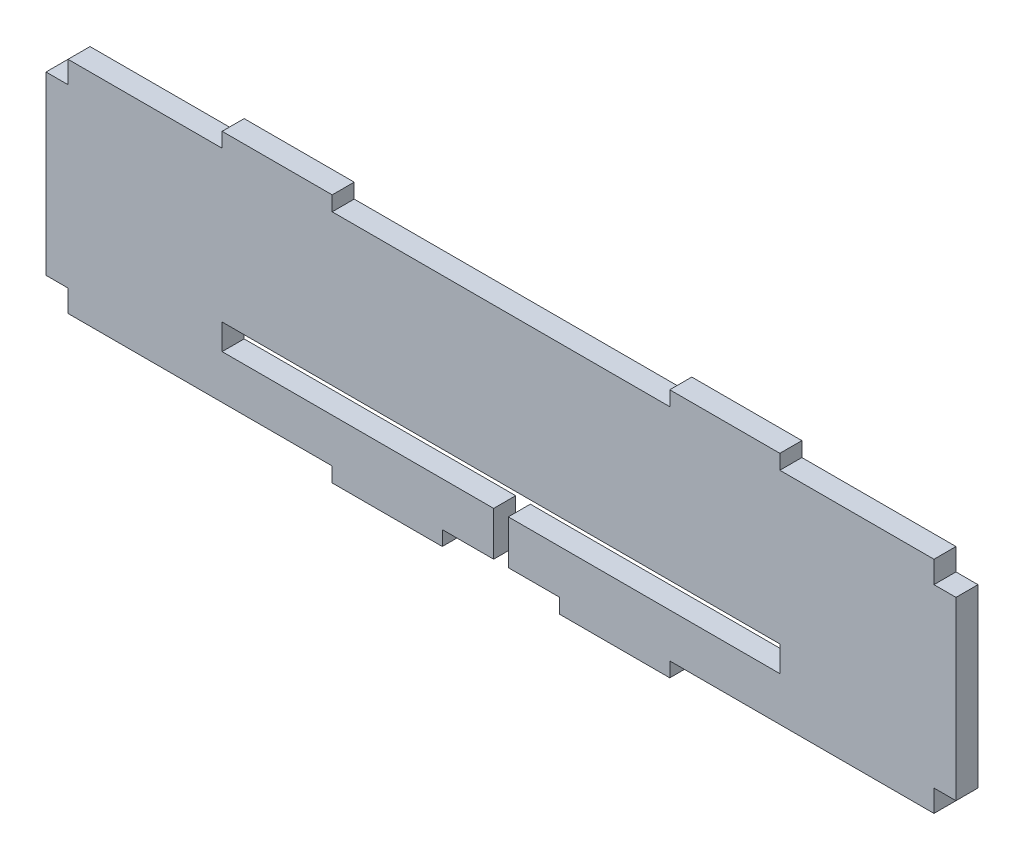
ISO-10303-21;
HEADER;
FILE_DESCRIPTION(('STEP AP214'),'2;1');
FILE_NAME('part.step','',(''),(''),'','','');
FILE_SCHEMA(('AUTOMOTIVE_DESIGN { 1 0 10303 214 1 1 1 1 }'));
ENDSEC;
DATA;
#1=APPLICATION_CONTEXT('core data for automotive mechanical design processes');
#2=APPLICATION_PROTOCOL_DEFINITION('international standard','automotive_design',2000,#1);
#3=PRODUCT_CONTEXT('',#1,'mechanical');
#4=PRODUCT('Part','Part','',(#3));
#5=PRODUCT_RELATED_PRODUCT_CATEGORY('part','',(#4));
#6=PRODUCT_DEFINITION_FORMATION('','',#4);
#7=PRODUCT_DEFINITION_CONTEXT('part definition',#1,'design');
#8=PRODUCT_DEFINITION('design','',#6,#7);
#9=PRODUCT_DEFINITION_SHAPE('','',#8);
#10=(LENGTH_UNIT() NAMED_UNIT(*) SI_UNIT(.MILLI.,.METRE.));
#11=(NAMED_UNIT(*) PLANE_ANGLE_UNIT() SI_UNIT($,.RADIAN.));
#12=(NAMED_UNIT(*) SI_UNIT($,.STERADIAN.) SOLID_ANGLE_UNIT());
#13=UNCERTAINTY_MEASURE_WITH_UNIT(LENGTH_MEASURE(1.E-05),#10,'distance_accuracy_value','');
#14=(GEOMETRIC_REPRESENTATION_CONTEXT(3) GLOBAL_UNCERTAINTY_ASSIGNED_CONTEXT((#13)) GLOBAL_UNIT_ASSIGNED_CONTEXT((#10,
#11,#12)) REPRESENTATION_CONTEXT('',''));
#15=CARTESIAN_POINT('',(0.,0.,0.));
#16=DIRECTION('',(0.,0.,1.));
#17=DIRECTION('',(1.,0.,0.));
#18=AXIS2_PLACEMENT_3D('',#15,#16,#17);
#19=CARTESIAN_POINT('',(0.,30.,3.));
#20=DIRECTION('',(0.,1.,0.));
#21=DIRECTION('',(0.,0.,1.));
#22=AXIS2_PLACEMENT_3D('',#19,#20,#21);
#23=PLANE('',#22);
#24=DIRECTION('',(1.,0.,0.));
#25=VECTOR('',#24,1.);
#26=CARTESIAN_POINT('',(0.,30.,0.));
#27=LINE('',#26,#25);
#28=CARTESIAN_POINT('',(6.00000000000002,30.,0.));
#29=VERTEX_POINT('',#28);
#30=CARTESIAN_POINT('',(27.,30.,0.));
#31=VERTEX_POINT('',#30);
#32=EDGE_CURVE('E299',#29,#31,#27,.T.);
#33=ORIENTED_EDGE('',*,*,#32,.F.);
#34=DIRECTION('',(0.,0.,-1.));
#35=VECTOR('',#34,1.);
#36=CARTESIAN_POINT('',(6.00000000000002,30.,3.));
#37=LINE('',#36,#35);
#38=CARTESIAN_POINT('',(6.00000000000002,30.,3.));
#39=VERTEX_POINT('',#38);
#40=EDGE_CURVE('E11',#39,#29,#37,.T.);
#41=ORIENTED_EDGE('',*,*,#40,.F.);
#42=DIRECTION('',(1.,0.,0.));
#43=VECTOR('',#42,1.);
#44=CARTESIAN_POINT('',(0.,30.,3.));
#45=LINE('',#44,#43);
#46=CARTESIAN_POINT('',(27.,30.,3.));
#47=VERTEX_POINT('',#46);
#48=EDGE_CURVE('E389',#39,#47,#45,.T.);
#49=ORIENTED_EDGE('',*,*,#48,.T.);
#50=DIRECTION('',(0.,0.,-1.));
#51=VECTOR('',#50,1.);
#52=CARTESIAN_POINT('',(27.,30.,3.));
#53=LINE('',#52,#51);
#54=EDGE_CURVE('E53',#47,#31,#53,.T.);
#55=ORIENTED_EDGE('',*,*,#54,.T.);
#56=EDGE_LOOP('',(#33,#41,#49,#55));
#57=FACE_BOUND('',#56,.T.);
#58=ADVANCED_FACE('F37',(#57),#23,.T.);
#59=CARTESIAN_POINT('',(6.00000000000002,0.,3.));
#60=DIRECTION('',(1.,0.,0.));
#61=DIRECTION('',(0.,0.,-1.));
#62=AXIS2_PLACEMENT_3D('',#59,#60,#61);
#63=PLANE('',#62);
#64=DIRECTION('',(0.,-1.,0.));
#65=VECTOR('',#64,1.);
#66=CARTESIAN_POINT('',(6.00000000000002,0.,0.));
#67=LINE('',#66,#65);
#68=CARTESIAN_POINT('',(6.00000000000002,27.,0.));
#69=VERTEX_POINT('',#68);
#70=EDGE_CURVE('E301',#29,#69,#67,.T.);
#71=ORIENTED_EDGE('',*,*,#70,.T.);
#72=DIRECTION('',(0.,0.,-1.));
#73=VECTOR('',#72,1.);
#74=CARTESIAN_POINT('',(6.00000000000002,27.,3.));
#75=LINE('',#74,#73);
#76=CARTESIAN_POINT('',(6.00000000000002,27.,3.));
#77=VERTEX_POINT('',#76);
#78=EDGE_CURVE('E45',#77,#69,#75,.T.);
#79=ORIENTED_EDGE('',*,*,#78,.F.);
#80=DIRECTION('',(0.,-1.,0.));
#81=VECTOR('',#80,1.);
#82=CARTESIAN_POINT('',(6.00000000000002,0.,3.));
#83=LINE('',#82,#81);
#84=EDGE_CURVE('E485',#39,#77,#83,.T.);
#85=ORIENTED_EDGE('',*,*,#84,.F.);
#86=ORIENTED_EDGE('',*,*,#40,.T.);
#87=EDGE_LOOP('',(#71,#79,#85,#86));
#88=FACE_BOUND('',#87,.T.);
#89=ADVANCED_FACE('F474',(#88),#63,.F.);
#90=CARTESIAN_POINT('',(0.,27.,3.));
#91=DIRECTION('',(0.,1.,0.));
#92=DIRECTION('',(0.,0.,1.));
#93=AXIS2_PLACEMENT_3D('',#90,#91,#92);
#94=PLANE('',#93);
#95=DIRECTION('',(1.,0.,0.));
#96=VECTOR('',#95,1.);
#97=CARTESIAN_POINT('',(0.,27.,0.));
#98=LINE('',#97,#96);
#99=CARTESIAN_POINT('',(3.00000000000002,27.,0.));
#100=VERTEX_POINT('',#99);
#101=EDGE_CURVE('E304',#100,#69,#98,.T.);
#102=ORIENTED_EDGE('',*,*,#101,.F.);
#103=DIRECTION('',(0.,0.,-1.));
#104=VECTOR('',#103,1.);
#105=CARTESIAN_POINT('',(3.00000000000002,27.,3.));
#106=LINE('',#105,#104);
#107=CARTESIAN_POINT('',(3.00000000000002,27.,3.));
#108=VERTEX_POINT('',#107);
#109=EDGE_CURVE('E464',#108,#100,#106,.T.);
#110=ORIENTED_EDGE('',*,*,#109,.F.);
#111=DIRECTION('',(1.,0.,0.));
#112=VECTOR('',#111,1.);
#113=CARTESIAN_POINT('',(0.,27.,3.));
#114=LINE('',#113,#112);
#115=EDGE_CURVE('E471',#108,#77,#114,.T.);
#116=ORIENTED_EDGE('',*,*,#115,.T.);
#117=ORIENTED_EDGE('',*,*,#78,.T.);
#118=EDGE_LOOP('',(#102,#110,#116,#117));
#119=FACE_BOUND('',#118,.T.);
#120=ADVANCED_FACE('F469',(#119),#94,.T.);
#121=CARTESIAN_POINT('',(3.00000000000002,0.,3.));
#122=DIRECTION('',(-1.,0.,0.));
#123=DIRECTION('',(0.,0.,1.));
#124=AXIS2_PLACEMENT_3D('',#121,#122,#123);
#125=PLANE('',#124);
#126=DIRECTION('',(0.,1.,0.));
#127=VECTOR('',#126,1.);
#128=CARTESIAN_POINT('',(3.00000000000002,0.,0.));
#129=LINE('',#128,#127);
#130=CARTESIAN_POINT('',(3.00000000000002,3.,0.));
#131=VERTEX_POINT('',#130);
#132=EDGE_CURVE('E307',#131,#100,#129,.T.);
#133=ORIENTED_EDGE('',*,*,#132,.F.);
#134=DIRECTION('',(0.,0.,-1.));
#135=VECTOR('',#134,1.);
#136=CARTESIAN_POINT('',(3.00000000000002,3.,3.));
#137=LINE('',#136,#135);
#138=CARTESIAN_POINT('',(3.00000000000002,3.,3.));
#139=VERTEX_POINT('',#138);
#140=EDGE_CURVE('E462',#139,#131,#137,.T.);
#141=ORIENTED_EDGE('',*,*,#140,.F.);
#142=DIRECTION('',(0.,1.,0.));
#143=VECTOR('',#142,1.);
#144=CARTESIAN_POINT('',(3.00000000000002,0.,3.));
#145=LINE('',#144,#143);
#146=EDGE_CURVE('E484',#139,#108,#145,.T.);
#147=ORIENTED_EDGE('',*,*,#146,.T.);
#148=ORIENTED_EDGE('',*,*,#109,.T.);
#149=EDGE_LOOP('',(#133,#141,#147,#148));
#150=FACE_BOUND('',#149,.T.);
#151=ADVANCED_FACE('F480',(#150),#125,.T.);
#152=CARTESIAN_POINT('',(0.,3.,3.));
#153=DIRECTION('',(0.,1.,0.));
#154=DIRECTION('',(0.,0.,1.));
#155=AXIS2_PLACEMENT_3D('',#152,#153,#154);
#156=PLANE('',#155);
#157=DIRECTION('',(1.,0.,0.));
#158=VECTOR('',#157,1.);
#159=CARTESIAN_POINT('',(0.,3.,0.));
#160=LINE('',#159,#158);
#161=CARTESIAN_POINT('',(6.00000000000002,3.,0.));
#162=VERTEX_POINT('',#161);
#163=EDGE_CURVE('E310',#131,#162,#160,.T.);
#164=ORIENTED_EDGE('',*,*,#163,.T.);
#165=DIRECTION('',(0.,0.,-1.));
#166=VECTOR('',#165,1.);
#167=CARTESIAN_POINT('',(6.00000000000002,3.,3.));
#168=LINE('',#167,#166);
#169=CARTESIAN_POINT('',(6.00000000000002,3.,3.));
#170=VERTEX_POINT('',#169);
#171=EDGE_CURVE('E460',#170,#162,#168,.T.);
#172=ORIENTED_EDGE('',*,*,#171,.F.);
#173=DIRECTION('',(1.,0.,0.));
#174=VECTOR('',#173,1.);
#175=CARTESIAN_POINT('',(0.,3.,3.));
#176=LINE('',#175,#174);
#177=EDGE_CURVE('E487',#139,#170,#176,.T.);
#178=ORIENTED_EDGE('',*,*,#177,.F.);
#179=ORIENTED_EDGE('',*,*,#140,.T.);
#180=EDGE_LOOP('',(#164,#172,#178,#179));
#181=FACE_BOUND('',#180,.T.);
#182=ADVANCED_FACE('F579',(#181),#156,.F.);
#183=CARTESIAN_POINT('',(6.00000000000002,0.,3.));
#184=DIRECTION('',(-1.,0.,0.));
#185=DIRECTION('',(0.,0.,1.));
#186=AXIS2_PLACEMENT_3D('',#183,#184,#185);
#187=PLANE('',#186);
#188=DIRECTION('',(0.,1.,0.));
#189=VECTOR('',#188,1.);
#190=CARTESIAN_POINT('',(6.00000000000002,0.,0.));
#191=LINE('',#190,#189);
#192=CARTESIAN_POINT('',(6.00000000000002,0.,0.));
#193=VERTEX_POINT('',#192);
#194=EDGE_CURVE('E313',#193,#162,#191,.T.);
#195=ORIENTED_EDGE('',*,*,#194,.F.);
#196=DIRECTION('',(0.,0.,-1.));
#197=VECTOR('',#196,1.);
#198=CARTESIAN_POINT('',(6.00000000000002,0.,3.));
#199=LINE('',#198,#197);
#200=CARTESIAN_POINT('',(6.00000000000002,0.,3.));
#201=VERTEX_POINT('',#200);
#202=EDGE_CURVE('E458',#201,#193,#199,.T.);
#203=ORIENTED_EDGE('',*,*,#202,.F.);
#204=DIRECTION('',(0.,1.,0.));
#205=VECTOR('',#204,1.);
#206=CARTESIAN_POINT('',(6.00000000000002,0.,3.));
#207=LINE('',#206,#205);
#208=EDGE_CURVE('E493',#201,#170,#207,.T.);
#209=ORIENTED_EDGE('',*,*,#208,.T.);
#210=ORIENTED_EDGE('',*,*,#171,.T.);
#211=EDGE_LOOP('',(#195,#203,#209,#210));
#212=FACE_BOUND('',#211,.T.);
#213=ADVANCED_FACE('F582',(#212),#187,.T.);
#214=CARTESIAN_POINT('',(0.,0.,3.));
#215=DIRECTION('',(0.,1.,0.));
#216=DIRECTION('',(0.,0.,1.));
#217=AXIS2_PLACEMENT_3D('',#214,#215,#216);
#218=PLANE('',#217);
#219=DIRECTION('',(1.,0.,0.));
#220=VECTOR('',#219,1.);
#221=CARTESIAN_POINT('',(0.,0.,0.));
#222=LINE('',#221,#220);
#223=CARTESIAN_POINT('',(42.,0.,0.));
#224=VERTEX_POINT('',#223);
#225=EDGE_CURVE('E316',#193,#224,#222,.T.);
#226=ORIENTED_EDGE('',*,*,#225,.T.);
#227=DIRECTION('',(0.,0.,-1.));
#228=VECTOR('',#227,1.);
#229=CARTESIAN_POINT('',(42.,0.,3.));
#230=LINE('',#229,#228);
#231=CARTESIAN_POINT('',(42.,0.,3.));
#232=VERTEX_POINT('',#231);
#233=EDGE_CURVE('E455',#232,#224,#230,.T.);
#234=ORIENTED_EDGE('',*,*,#233,.F.);
#235=DIRECTION('',(1.,0.,0.));
#236=VECTOR('',#235,1.);
#237=CARTESIAN_POINT('',(0.,0.,3.));
#238=LINE('',#237,#236);
#239=EDGE_CURVE('E496',#201,#232,#238,.T.);
#240=ORIENTED_EDGE('',*,*,#239,.F.);
#241=ORIENTED_EDGE('',*,*,#202,.T.);
#242=EDGE_LOOP('',(#226,#234,#240,#241));
#243=FACE_BOUND('',#242,.T.);
#244=ADVANCED_FACE('F586',(#243),#218,.F.);
#245=CARTESIAN_POINT('',(42.,2.91433543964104E-13,3.));
#246=DIRECTION('',(1.,0.,0.));
#247=DIRECTION('',(0.,1.,0.));
#248=AXIS2_PLACEMENT_3D('',#245,#246,#247);
#249=PLANE('',#248);
#250=DIRECTION('',(0.,-1.,0.));
#251=VECTOR('',#250,1.);
#252=CARTESIAN_POINT('',(42.,2.91433543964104E-13,0.));
#253=LINE('',#252,#251);
#254=CARTESIAN_POINT('',(42.,-2.,0.));
#255=VERTEX_POINT('',#254);
#256=EDGE_CURVE('E318',#224,#255,#253,.T.);
#257=ORIENTED_EDGE('',*,*,#256,.T.);
#258=DIRECTION('',(0.,0.,-1.));
#259=VECTOR('',#258,1.);
#260=CARTESIAN_POINT('',(42.,-2.,3.));
#261=LINE('',#260,#259);
#262=CARTESIAN_POINT('',(42.,-2.,3.));
#263=VERTEX_POINT('',#262);
#264=EDGE_CURVE('E452',#263,#255,#261,.T.);
#265=ORIENTED_EDGE('',*,*,#264,.F.);
#266=DIRECTION('',(0.,-1.,0.));
#267=VECTOR('',#266,1.);
#268=CARTESIAN_POINT('',(42.,2.91433543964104E-13,3.));
#269=LINE('',#268,#267);
#270=EDGE_CURVE('E498',#232,#263,#269,.T.);
#271=ORIENTED_EDGE('',*,*,#270,.F.);
#272=ORIENTED_EDGE('',*,*,#233,.T.);
#273=EDGE_LOOP('',(#257,#265,#271,#272));
#274=FACE_BOUND('',#273,.T.);
#275=ADVANCED_FACE('F590',(#274),#249,.F.);
#276=CARTESIAN_POINT('',(0.,-2.,3.));
#277=DIRECTION('',(0.,1.,0.));
#278=DIRECTION('',(-1.,0.,0.));
#279=AXIS2_PLACEMENT_3D('',#276,#277,#278);
#280=PLANE('',#279);
#281=DIRECTION('',(1.,0.,0.));
#282=VECTOR('',#281,1.);
#283=CARTESIAN_POINT('',(0.,-2.,0.));
#284=LINE('',#283,#282);
#285=CARTESIAN_POINT('',(57.,-2.,0.));
#286=VERTEX_POINT('',#285);
#287=EDGE_CURVE('E320',#255,#286,#284,.T.);
#288=ORIENTED_EDGE('',*,*,#287,.T.);
#289=DIRECTION('',(0.,0.,-1.));
#290=VECTOR('',#289,1.);
#291=CARTESIAN_POINT('',(57.,-2.,3.));
#292=LINE('',#291,#290);
#293=CARTESIAN_POINT('',(57.,-2.,3.));
#294=VERTEX_POINT('',#293);
#295=EDGE_CURVE('E449',#294,#286,#292,.T.);
#296=ORIENTED_EDGE('',*,*,#295,.F.);
#297=DIRECTION('',(1.,0.,0.));
#298=VECTOR('',#297,1.);
#299=CARTESIAN_POINT('',(0.,-2.,3.));
#300=LINE('',#299,#298);
#301=EDGE_CURVE('E500',#263,#294,#300,.T.);
#302=ORIENTED_EDGE('',*,*,#301,.F.);
#303=ORIENTED_EDGE('',*,*,#264,.T.);
#304=EDGE_LOOP('',(#288,#296,#302,#303));
#305=FACE_BOUND('',#304,.T.);
#306=ADVANCED_FACE('F594',(#305),#280,.F.);
#307=CARTESIAN_POINT('',(57.,0.,3.));
#308=DIRECTION('',(-1.,0.,0.));
#309=DIRECTION('',(0.,0.,1.));
#310=AXIS2_PLACEMENT_3D('',#307,#308,#309);
#311=PLANE('',#310);
#312=DIRECTION('',(0.,1.,0.));
#313=VECTOR('',#312,1.);
#314=CARTESIAN_POINT('',(57.,0.,0.));
#315=LINE('',#314,#313);
#316=CARTESIAN_POINT('',(57.,0.,0.));
#317=VERTEX_POINT('',#316);
#318=EDGE_CURVE('E322',#286,#317,#315,.T.);
#319=ORIENTED_EDGE('',*,*,#318,.T.);
#320=DIRECTION('',(0.,0.,-1.));
#321=VECTOR('',#320,1.);
#322=CARTESIAN_POINT('',(57.,0.,3.));
#323=LINE('',#322,#321);
#324=CARTESIAN_POINT('',(57.,0.,3.));
#325=VERTEX_POINT('',#324);
#326=EDGE_CURVE('E446',#325,#317,#323,.T.);
#327=ORIENTED_EDGE('',*,*,#326,.F.);
#328=DIRECTION('',(0.,1.,0.));
#329=VECTOR('',#328,1.);
#330=CARTESIAN_POINT('',(57.,0.,3.));
#331=LINE('',#330,#329);
#332=EDGE_CURVE('E502',#294,#325,#331,.T.);
#333=ORIENTED_EDGE('',*,*,#332,.F.);
#334=ORIENTED_EDGE('',*,*,#295,.T.);
#335=EDGE_LOOP('',(#319,#327,#333,#334));
#336=FACE_BOUND('',#335,.T.);
#337=ADVANCED_FACE('F598',(#336),#311,.F.);
#338=CARTESIAN_POINT('',(0.,0.,3.));
#339=DIRECTION('',(0.,1.,0.));
#340=DIRECTION('',(-1.,0.,0.));
#341=AXIS2_PLACEMENT_3D('',#338,#339,#340);
#342=PLANE('',#341);
#343=DIRECTION('',(1.,0.,0.));
#344=VECTOR('',#343,1.);
#345=CARTESIAN_POINT('',(0.,0.,0.));
#346=LINE('',#345,#344);
#347=CARTESIAN_POINT('',(64.,0.,0.));
#348=VERTEX_POINT('',#347);
#349=EDGE_CURVE('E324',#317,#348,#346,.T.);
#350=ORIENTED_EDGE('',*,*,#349,.T.);
#351=DIRECTION('',(0.,0.,-1.));
#352=VECTOR('',#351,1.);
#353=CARTESIAN_POINT('',(64.,0.,3.));
#354=LINE('',#353,#352);
#355=CARTESIAN_POINT('',(64.,0.,3.));
#356=VERTEX_POINT('',#355);
#357=EDGE_CURVE('E443',#356,#348,#354,.T.);
#358=ORIENTED_EDGE('',*,*,#357,.F.);
#359=DIRECTION('',(1.,0.,0.));
#360=VECTOR('',#359,1.);
#361=CARTESIAN_POINT('',(0.,0.,3.));
#362=LINE('',#361,#360);
#363=EDGE_CURVE('E504',#325,#356,#362,.T.);
#364=ORIENTED_EDGE('',*,*,#363,.F.);
#365=ORIENTED_EDGE('',*,*,#326,.T.);
#366=EDGE_LOOP('',(#350,#358,#364,#365));
#367=FACE_BOUND('',#366,.T.);
#368=ADVANCED_FACE('F602',(#367),#342,.F.);
#369=CARTESIAN_POINT('',(64.,0.,3.));
#370=DIRECTION('',(-1.,0.,0.));
#371=DIRECTION('',(0.,0.,1.));
#372=AXIS2_PLACEMENT_3D('',#369,#370,#371);
#373=PLANE('',#372);
#374=DIRECTION('',(0.,1.,0.));
#375=VECTOR('',#374,1.);
#376=CARTESIAN_POINT('',(64.,0.,0.));
#377=LINE('',#376,#375);
#378=CARTESIAN_POINT('',(64.,6.,0.));
#379=VERTEX_POINT('',#378);
#380=EDGE_CURVE('E326',#348,#379,#377,.T.);
#381=ORIENTED_EDGE('',*,*,#380,.T.);
#382=DIRECTION('',(0.,0.,-1.));
#383=VECTOR('',#382,1.);
#384=CARTESIAN_POINT('',(64.,6.,3.));
#385=LINE('',#384,#383);
#386=CARTESIAN_POINT('',(64.,6.,3.));
#387=VERTEX_POINT('',#386);
#388=EDGE_CURVE('E441',#387,#379,#385,.T.);
#389=ORIENTED_EDGE('',*,*,#388,.F.);
#390=DIRECTION('',(0.,1.,0.));
#391=VECTOR('',#390,1.);
#392=CARTESIAN_POINT('',(64.,0.,3.));
#393=LINE('',#392,#391);
#394=EDGE_CURVE('E506',#356,#387,#393,.T.);
#395=ORIENTED_EDGE('',*,*,#394,.F.);
#396=ORIENTED_EDGE('',*,*,#357,.T.);
#397=EDGE_LOOP('',(#381,#389,#395,#396));
#398=FACE_BOUND('',#397,.T.);
#399=ADVANCED_FACE('F604',(#398),#373,.F.);
#400=CARTESIAN_POINT('',(0.,6.,3.));
#401=DIRECTION('',(0.,1.,0.));
#402=DIRECTION('',(0.,0.,1.));
#403=AXIS2_PLACEMENT_3D('',#400,#401,#402);
#404=PLANE('',#403);
#405=DIRECTION('',(1.,0.,0.));
#406=VECTOR('',#405,1.);
#407=CARTESIAN_POINT('',(0.,6.,0.));
#408=LINE('',#407,#406);
#409=CARTESIAN_POINT('',(27.,6.,0.));
#410=VERTEX_POINT('',#409);
#411=EDGE_CURVE('E330',#410,#379,#408,.T.);
#412=ORIENTED_EDGE('',*,*,#411,.F.);
#413=DIRECTION('',(0.,0.,-1.));
#414=VECTOR('',#413,1.);
#415=CARTESIAN_POINT('',(27.,6.,3.));
#416=LINE('',#415,#414);
#417=CARTESIAN_POINT('',(27.,6.,3.));
#418=VERTEX_POINT('',#417);
#419=EDGE_CURVE('E439',#418,#410,#416,.T.);
#420=ORIENTED_EDGE('',*,*,#419,.F.);
#421=DIRECTION('',(1.,0.,0.));
#422=VECTOR('',#421,1.);
#423=CARTESIAN_POINT('',(0.,6.,3.));
#424=LINE('',#423,#422);
#425=EDGE_CURVE('E509',#418,#387,#424,.T.);
#426=ORIENTED_EDGE('',*,*,#425,.T.);
#427=ORIENTED_EDGE('',*,*,#388,.T.);
#428=EDGE_LOOP('',(#412,#420,#426,#427));
#429=FACE_BOUND('',#428,.T.);
#430=ADVANCED_FACE('F607',(#429),#404,.T.);
#431=CARTESIAN_POINT('',(27.,0.,3.));
#432=DIRECTION('',(1.,0.,0.));
#433=DIRECTION('',(0.,0.,-1.));
#434=AXIS2_PLACEMENT_3D('',#431,#432,#433);
#435=PLANE('',#434);
#436=DIRECTION('',(0.,-1.,0.));
#437=VECTOR('',#436,1.);
#438=CARTESIAN_POINT('',(27.,0.,0.));
#439=LINE('',#438,#437);
#440=CARTESIAN_POINT('',(27.,9.5,0.));
#441=VERTEX_POINT('',#440);
#442=EDGE_CURVE('E333',#441,#410,#439,.T.);
#443=ORIENTED_EDGE('',*,*,#442,.F.);
#444=DIRECTION('',(0.,0.,-1.));
#445=VECTOR('',#444,1.);
#446=CARTESIAN_POINT('',(27.,9.5,3.));
#447=LINE('',#446,#445);
#448=CARTESIAN_POINT('',(27.,9.5,3.));
#449=VERTEX_POINT('',#448);
#450=EDGE_CURVE('E437',#449,#441,#447,.T.);
#451=ORIENTED_EDGE('',*,*,#450,.F.);
#452=DIRECTION('',(0.,-1.,0.));
#453=VECTOR('',#452,1.);
#454=CARTESIAN_POINT('',(27.,0.,3.));
#455=LINE('',#454,#453);
#456=EDGE_CURVE('E512',#449,#418,#455,.T.);
#457=ORIENTED_EDGE('',*,*,#456,.T.);
#458=ORIENTED_EDGE('',*,*,#419,.T.);
#459=EDGE_LOOP('',(#443,#451,#457,#458));
#460=FACE_BOUND('',#459,.T.);
#461=ADVANCED_FACE('F611',(#460),#435,.T.);
#462=CARTESIAN_POINT('',(0.,9.5,3.));
#463=DIRECTION('',(0.,1.,0.));
#464=DIRECTION('',(0.,0.,1.));
#465=AXIS2_PLACEMENT_3D('',#462,#463,#464);
#466=PLANE('',#465);
#467=DIRECTION('',(1.,0.,0.));
#468=VECTOR('',#467,1.);
#469=CARTESIAN_POINT('',(0.,9.5,0.));
#470=LINE('',#469,#468);
#471=CARTESIAN_POINT('',(103.,9.5,0.));
#472=VERTEX_POINT('',#471);
#473=EDGE_CURVE('E336',#441,#472,#470,.T.);
#474=ORIENTED_EDGE('',*,*,#473,.T.);
#475=DIRECTION('',(0.,0.,-1.));
#476=VECTOR('',#475,1.);
#477=CARTESIAN_POINT('',(103.,9.5,3.));
#478=LINE('',#477,#476);
#479=CARTESIAN_POINT('',(103.,9.5,3.));
#480=VERTEX_POINT('',#479);
#481=EDGE_CURVE('E434',#480,#472,#478,.T.);
#482=ORIENTED_EDGE('',*,*,#481,.F.);
#483=DIRECTION('',(1.,0.,0.));
#484=VECTOR('',#483,1.);
#485=CARTESIAN_POINT('',(0.,9.5,3.));
#486=LINE('',#485,#484);
#487=EDGE_CURVE('E515',#449,#480,#486,.T.);
#488=ORIENTED_EDGE('',*,*,#487,.F.);
#489=ORIENTED_EDGE('',*,*,#450,.T.);
#490=EDGE_LOOP('',(#474,#482,#488,#489));
#491=FACE_BOUND('',#490,.T.);
#492=ADVANCED_FACE('F615',(#491),#466,.F.);
#493=CARTESIAN_POINT('',(103.,0.,3.));
#494=DIRECTION('',(1.,0.,0.));
#495=DIRECTION('',(0.,0.,-1.));
#496=AXIS2_PLACEMENT_3D('',#493,#494,#495);
#497=PLANE('',#496);
#498=DIRECTION('',(0.,-1.,0.));
#499=VECTOR('',#498,1.);
#500=CARTESIAN_POINT('',(103.,0.,0.));
#501=LINE('',#500,#499);
#502=CARTESIAN_POINT('',(103.,6.,0.));
#503=VERTEX_POINT('',#502);
#504=EDGE_CURVE('E338',#472,#503,#501,.T.);
#505=ORIENTED_EDGE('',*,*,#504,.T.);
#506=DIRECTION('',(0.,0.,-1.));
#507=VECTOR('',#506,1.);
#508=CARTESIAN_POINT('',(103.,6.,3.));
#509=LINE('',#508,#507);
#510=CARTESIAN_POINT('',(103.,6.,3.));
#511=VERTEX_POINT('',#510);
#512=EDGE_CURVE('E432',#511,#503,#509,.T.);
#513=ORIENTED_EDGE('',*,*,#512,.F.);
#514=DIRECTION('',(0.,-1.,0.));
#515=VECTOR('',#514,1.);
#516=CARTESIAN_POINT('',(103.,0.,3.));
#517=LINE('',#516,#515);
#518=EDGE_CURVE('E517',#480,#511,#517,.T.);
#519=ORIENTED_EDGE('',*,*,#518,.F.);
#520=ORIENTED_EDGE('',*,*,#481,.T.);
#521=EDGE_LOOP('',(#505,#513,#519,#520));
#522=FACE_BOUND('',#521,.T.);
#523=ADVANCED_FACE('F619',(#522),#497,.F.);
#524=CARTESIAN_POINT('',(0.,6.,3.));
#525=DIRECTION('',(0.,1.,0.));
#526=DIRECTION('',(0.,0.,1.));
#527=AXIS2_PLACEMENT_3D('',#524,#525,#526);
#528=PLANE('',#527);
#529=DIRECTION('',(1.,0.,0.));
#530=VECTOR('',#529,1.);
#531=CARTESIAN_POINT('',(0.,6.,0.));
#532=LINE('',#531,#530);
#533=CARTESIAN_POINT('',(66.,6.,0.));
#534=VERTEX_POINT('',#533);
#535=EDGE_CURVE('E341',#534,#503,#532,.T.);
#536=ORIENTED_EDGE('',*,*,#535,.F.);
#537=DIRECTION('',(0.,0.,-1.));
#538=VECTOR('',#537,1.);
#539=CARTESIAN_POINT('',(66.,6.,3.));
#540=LINE('',#539,#538);
#541=CARTESIAN_POINT('',(66.,6.,3.));
#542=VERTEX_POINT('',#541);
#543=EDGE_CURVE('E430',#542,#534,#540,.T.);
#544=ORIENTED_EDGE('',*,*,#543,.F.);
#545=DIRECTION('',(1.,0.,0.));
#546=VECTOR('',#545,1.);
#547=CARTESIAN_POINT('',(0.,6.,3.));
#548=LINE('',#547,#546);
#549=EDGE_CURVE('E519',#542,#511,#548,.T.);
#550=ORIENTED_EDGE('',*,*,#549,.T.);
#551=ORIENTED_EDGE('',*,*,#512,.T.);
#552=EDGE_LOOP('',(#536,#544,#550,#551));
#553=FACE_BOUND('',#552,.T.);
#554=ADVANCED_FACE('F623',(#553),#528,.T.);
#555=CARTESIAN_POINT('',(66.,0.,3.));
#556=DIRECTION('',(-1.,0.,0.));
#557=DIRECTION('',(0.,0.,1.));
#558=AXIS2_PLACEMENT_3D('',#555,#556,#557);
#559=PLANE('',#558);
#560=DIRECTION('',(0.,1.,0.));
#561=VECTOR('',#560,1.);
#562=CARTESIAN_POINT('',(66.,0.,0.));
#563=LINE('',#562,#561);
#564=CARTESIAN_POINT('',(66.,0.,0.));
#565=VERTEX_POINT('',#564);
#566=EDGE_CURVE('E344',#565,#534,#563,.T.);
#567=ORIENTED_EDGE('',*,*,#566,.F.);
#568=DIRECTION('',(0.,0.,-1.));
#569=VECTOR('',#568,1.);
#570=CARTESIAN_POINT('',(66.,0.,3.));
#571=LINE('',#570,#569);
#572=CARTESIAN_POINT('',(66.,0.,3.));
#573=VERTEX_POINT('',#572);
#574=EDGE_CURVE('E428',#573,#565,#571,.T.);
#575=ORIENTED_EDGE('',*,*,#574,.F.);
#576=DIRECTION('',(0.,1.,0.));
#577=VECTOR('',#576,1.);
#578=CARTESIAN_POINT('',(66.,0.,3.));
#579=LINE('',#578,#577);
#580=EDGE_CURVE('E522',#573,#542,#579,.T.);
#581=ORIENTED_EDGE('',*,*,#580,.T.);
#582=ORIENTED_EDGE('',*,*,#543,.T.);
#583=EDGE_LOOP('',(#567,#575,#581,#582));
#584=FACE_BOUND('',#583,.T.);
#585=ADVANCED_FACE('F627',(#584),#559,.T.);
#586=CARTESIAN_POINT('',(73.,0.,0.));
#587=VERTEX_POINT('',#586);
#588=EDGE_CURVE('E327',#565,#587,#346,.T.);
#589=ORIENTED_EDGE('',*,*,#588,.T.);
#590=DIRECTION('',(0.,0.,-1.));
#591=VECTOR('',#590,1.);
#592=CARTESIAN_POINT('',(73.,0.,3.));
#593=LINE('',#592,#591);
#594=CARTESIAN_POINT('',(73.,0.,3.));
#595=VERTEX_POINT('',#594);
#596=EDGE_CURVE('E425',#595,#587,#593,.T.);
#597=ORIENTED_EDGE('',*,*,#596,.F.);
#598=EDGE_CURVE('E507',#573,#595,#362,.T.);
#599=ORIENTED_EDGE('',*,*,#598,.F.);
#600=ORIENTED_EDGE('',*,*,#574,.T.);
#601=EDGE_LOOP('',(#589,#597,#599,#600));
#602=FACE_BOUND('',#601,.T.);
#603=ADVANCED_FACE('F631',(#602),#342,.F.);
#604=CARTESIAN_POINT('',(73.,0.,3.));
#605=DIRECTION('',(1.,0.,0.));
#606=DIRECTION('',(0.,0.,-1.));
#607=AXIS2_PLACEMENT_3D('',#604,#605,#606);
#608=PLANE('',#607);
#609=DIRECTION('',(0.,-1.,0.));
#610=VECTOR('',#609,1.);
#611=CARTESIAN_POINT('',(73.,0.,0.));
#612=LINE('',#611,#610);
#613=CARTESIAN_POINT('',(73.,-2.,0.));
#614=VERTEX_POINT('',#613);
#615=EDGE_CURVE('E347',#587,#614,#612,.T.);
#616=ORIENTED_EDGE('',*,*,#615,.T.);
#617=DIRECTION('',(0.,0.,-1.));
#618=VECTOR('',#617,1.);
#619=CARTESIAN_POINT('',(73.,-2.,3.));
#620=LINE('',#619,#618);
#621=CARTESIAN_POINT('',(73.,-2.,3.));
#622=VERTEX_POINT('',#621);
#623=EDGE_CURVE('E422',#622,#614,#620,.T.);
#624=ORIENTED_EDGE('',*,*,#623,.F.);
#625=DIRECTION('',(0.,-1.,0.));
#626=VECTOR('',#625,1.);
#627=CARTESIAN_POINT('',(73.,0.,3.));
#628=LINE('',#627,#626);
#629=EDGE_CURVE('E525',#595,#622,#628,.T.);
#630=ORIENTED_EDGE('',*,*,#629,.F.);
#631=ORIENTED_EDGE('',*,*,#596,.T.);
#632=EDGE_LOOP('',(#616,#624,#630,#631));
#633=FACE_BOUND('',#632,.T.);
#634=ADVANCED_FACE('F635',(#633),#608,.F.);
#635=CARTESIAN_POINT('',(0.,-2.,3.));
#636=DIRECTION('',(0.,1.,0.));
#637=DIRECTION('',(-1.,0.,0.));
#638=AXIS2_PLACEMENT_3D('',#635,#636,#637);
#639=PLANE('',#638);
#640=DIRECTION('',(1.,0.,0.));
#641=VECTOR('',#640,1.);
#642=CARTESIAN_POINT('',(0.,-2.,0.));
#643=LINE('',#642,#641);
#644=CARTESIAN_POINT('',(88.,-2.,0.));
#645=VERTEX_POINT('',#644);
#646=EDGE_CURVE('E349',#614,#645,#643,.T.);
#647=ORIENTED_EDGE('',*,*,#646,.T.);
#648=DIRECTION('',(0.,0.,-1.));
#649=VECTOR('',#648,1.);
#650=CARTESIAN_POINT('',(88.,-2.,3.));
#651=LINE('',#650,#649);
#652=CARTESIAN_POINT('',(88.,-2.,3.));
#653=VERTEX_POINT('',#652);
#654=EDGE_CURVE('E419',#653,#645,#651,.T.);
#655=ORIENTED_EDGE('',*,*,#654,.F.);
#656=DIRECTION('',(1.,0.,0.));
#657=VECTOR('',#656,1.);
#658=CARTESIAN_POINT('',(0.,-2.,3.));
#659=LINE('',#658,#657);
#660=EDGE_CURVE('E527',#622,#653,#659,.T.);
#661=ORIENTED_EDGE('',*,*,#660,.F.);
#662=ORIENTED_EDGE('',*,*,#623,.T.);
#663=EDGE_LOOP('',(#647,#655,#661,#662));
#664=FACE_BOUND('',#663,.T.);
#665=ADVANCED_FACE('F639',(#664),#639,.F.);
#666=CARTESIAN_POINT('',(88.,-6.10622663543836E-13,3.));
#667=DIRECTION('',(-1.,0.,0.));
#668=DIRECTION('',(0.,-1.,0.));
#669=AXIS2_PLACEMENT_3D('',#666,#667,#668);
#670=PLANE('',#669);
#671=DIRECTION('',(0.,1.,0.));
#672=VECTOR('',#671,1.);
#673=CARTESIAN_POINT('',(88.,-6.10622663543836E-13,0.));
#674=LINE('',#673,#672);
#675=CARTESIAN_POINT('',(88.,0.,0.));
#676=VERTEX_POINT('',#675);
#677=EDGE_CURVE('E351',#645,#676,#674,.T.);
#678=ORIENTED_EDGE('',*,*,#677,.T.);
#679=DIRECTION('',(0.,0.,-1.));
#680=VECTOR('',#679,1.);
#681=CARTESIAN_POINT('',(88.,0.,3.));
#682=LINE('',#681,#680);
#683=CARTESIAN_POINT('',(88.,0.,3.));
#684=VERTEX_POINT('',#683);
#685=EDGE_CURVE('E416',#684,#676,#682,.T.);
#686=ORIENTED_EDGE('',*,*,#685,.F.);
#687=DIRECTION('',(0.,1.,0.));
#688=VECTOR('',#687,1.);
#689=CARTESIAN_POINT('',(88.,-6.10622663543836E-13,3.));
#690=LINE('',#689,#688);
#691=EDGE_CURVE('E529',#653,#684,#690,.T.);
#692=ORIENTED_EDGE('',*,*,#691,.F.);
#693=ORIENTED_EDGE('',*,*,#654,.T.);
#694=EDGE_LOOP('',(#678,#686,#692,#693));
#695=FACE_BOUND('',#694,.T.);
#696=ADVANCED_FACE('F643',(#695),#670,.F.);
#697=CARTESIAN_POINT('',(0.,0.,3.));
#698=DIRECTION('',(0.,1.,0.));
#699=DIRECTION('',(-1.,0.,0.));
#700=AXIS2_PLACEMENT_3D('',#697,#698,#699);
#701=PLANE('',#700);
#702=DIRECTION('',(1.,0.,0.));
#703=VECTOR('',#702,1.);
#704=CARTESIAN_POINT('',(0.,0.,0.));
#705=LINE('',#704,#703);
#706=CARTESIAN_POINT('',(124.,0.,0.));
#707=VERTEX_POINT('',#706);
#708=EDGE_CURVE('E353',#676,#707,#705,.T.);
#709=ORIENTED_EDGE('',*,*,#708,.T.);
#710=DIRECTION('',(0.,0.,-1.));
#711=VECTOR('',#710,1.);
#712=CARTESIAN_POINT('',(124.,0.,3.));
#713=LINE('',#712,#711);
#714=CARTESIAN_POINT('',(124.,0.,3.));
#715=VERTEX_POINT('',#714);
#716=EDGE_CURVE('E413',#715,#707,#713,.T.);
#717=ORIENTED_EDGE('',*,*,#716,.F.);
#718=DIRECTION('',(1.,0.,0.));
#719=VECTOR('',#718,1.);
#720=CARTESIAN_POINT('',(0.,0.,3.));
#721=LINE('',#720,#719);
#722=EDGE_CURVE('E531',#684,#715,#721,.T.);
#723=ORIENTED_EDGE('',*,*,#722,.F.);
#724=ORIENTED_EDGE('',*,*,#685,.T.);
#725=EDGE_LOOP('',(#709,#717,#723,#724));
#726=FACE_BOUND('',#725,.T.);
#727=ADVANCED_FACE('F647',(#726),#701,.F.);
#728=CARTESIAN_POINT('',(124.,0.,3.));
#729=DIRECTION('',(-1.,0.,0.));
#730=DIRECTION('',(0.,0.,1.));
#731=AXIS2_PLACEMENT_3D('',#728,#729,#730);
#732=PLANE('',#731);
#733=DIRECTION('',(0.,1.,0.));
#734=VECTOR('',#733,1.);
#735=CARTESIAN_POINT('',(124.,0.,0.));
#736=LINE('',#735,#734);
#737=CARTESIAN_POINT('',(124.,3.00000000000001,0.));
#738=VERTEX_POINT('',#737);
#739=EDGE_CURVE('E355',#707,#738,#736,.T.);
#740=ORIENTED_EDGE('',*,*,#739,.T.);
#741=DIRECTION('',(0.,0.,-1.));
#742=VECTOR('',#741,1.);
#743=CARTESIAN_POINT('',(124.,3.00000000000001,3.));
#744=LINE('',#743,#742);
#745=CARTESIAN_POINT('',(124.,3.00000000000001,3.));
#746=VERTEX_POINT('',#745);
#747=EDGE_CURVE('E411',#746,#738,#744,.T.);
#748=ORIENTED_EDGE('',*,*,#747,.F.);
#749=DIRECTION('',(0.,1.,0.));
#750=VECTOR('',#749,1.);
#751=CARTESIAN_POINT('',(124.,0.,3.));
#752=LINE('',#751,#750);
#753=EDGE_CURVE('E533',#715,#746,#752,.T.);
#754=ORIENTED_EDGE('',*,*,#753,.F.);
#755=ORIENTED_EDGE('',*,*,#716,.T.);
#756=EDGE_LOOP('',(#740,#748,#754,#755));
#757=FACE_BOUND('',#756,.T.);
#758=ADVANCED_FACE('F651',(#757),#732,.F.);
#759=CARTESIAN_POINT('',(0.,2.99999999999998,3.));
#760=DIRECTION('',(0.,-1.,0.));
#761=DIRECTION('',(1.,0.,0.));
#762=AXIS2_PLACEMENT_3D('',#759,#760,#761);
#763=PLANE('',#762);
#764=DIRECTION('',(-1.,0.,0.));
#765=VECTOR('',#764,1.);
#766=CARTESIAN_POINT('',(0.,2.99999999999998,0.));
#767=LINE('',#766,#765);
#768=CARTESIAN_POINT('',(127.,3.00000000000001,0.));
#769=VERTEX_POINT('',#768);
#770=EDGE_CURVE('E358',#769,#738,#767,.T.);
#771=ORIENTED_EDGE('',*,*,#770,.F.);
#772=DIRECTION('',(0.,0.,-1.));
#773=VECTOR('',#772,1.);
#774=CARTESIAN_POINT('',(127.,3.00000000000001,3.));
#775=LINE('',#774,#773);
#776=CARTESIAN_POINT('',(127.,3.00000000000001,3.));
#777=VERTEX_POINT('',#776);
#778=EDGE_CURVE('E409',#777,#769,#775,.T.);
#779=ORIENTED_EDGE('',*,*,#778,.F.);
#780=DIRECTION('',(-1.,0.,0.));
#781=VECTOR('',#780,1.);
#782=CARTESIAN_POINT('',(0.,2.99999999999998,3.));
#783=LINE('',#782,#781);
#784=EDGE_CURVE('E535',#777,#746,#783,.T.);
#785=ORIENTED_EDGE('',*,*,#784,.T.);
#786=ORIENTED_EDGE('',*,*,#747,.T.);
#787=EDGE_LOOP('',(#771,#779,#785,#786));
#788=FACE_BOUND('',#787,.T.);
#789=ADVANCED_FACE('F655',(#788),#763,.T.);
#790=CARTESIAN_POINT('',(127.,0.,3.));
#791=DIRECTION('',(-1.,0.,0.));
#792=DIRECTION('',(0.,0.,1.));
#793=AXIS2_PLACEMENT_3D('',#790,#791,#792);
#794=PLANE('',#793);
#795=DIRECTION('',(0.,1.,0.));
#796=VECTOR('',#795,1.);
#797=CARTESIAN_POINT('',(127.,0.,0.));
#798=LINE('',#797,#796);
#799=CARTESIAN_POINT('',(127.,27.,0.));
#800=VERTEX_POINT('',#799);
#801=EDGE_CURVE('E361',#769,#800,#798,.T.);
#802=ORIENTED_EDGE('',*,*,#801,.T.);
#803=DIRECTION('',(0.,0.,-1.));
#804=VECTOR('',#803,1.);
#805=CARTESIAN_POINT('',(127.,27.,3.));
#806=LINE('',#805,#804);
#807=CARTESIAN_POINT('',(127.,27.,3.));
#808=VERTEX_POINT('',#807);
#809=EDGE_CURVE('E406',#808,#800,#806,.T.);
#810=ORIENTED_EDGE('',*,*,#809,.F.);
#811=DIRECTION('',(0.,1.,0.));
#812=VECTOR('',#811,1.);
#813=CARTESIAN_POINT('',(127.,0.,3.));
#814=LINE('',#813,#812);
#815=EDGE_CURVE('E538',#777,#808,#814,.T.);
#816=ORIENTED_EDGE('',*,*,#815,.F.);
#817=ORIENTED_EDGE('',*,*,#778,.T.);
#818=EDGE_LOOP('',(#802,#810,#816,#817));
#819=FACE_BOUND('',#818,.T.);
#820=ADVANCED_FACE('F659',(#819),#794,.F.);
#821=CARTESIAN_POINT('',(0.,26.9999999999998,3.));
#822=DIRECTION('',(0.,-1.,0.));
#823=DIRECTION('',(1.,0.,0.));
#824=AXIS2_PLACEMENT_3D('',#821,#822,#823);
#825=PLANE('',#824);
#826=DIRECTION('',(-1.,0.,0.));
#827=VECTOR('',#826,1.);
#828=CARTESIAN_POINT('',(0.,26.9999999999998,0.));
#829=LINE('',#828,#827);
#830=CARTESIAN_POINT('',(124.,27.,0.));
#831=VERTEX_POINT('',#830);
#832=EDGE_CURVE('E363',#800,#831,#829,.T.);
#833=ORIENTED_EDGE('',*,*,#832,.T.);
#834=DIRECTION('',(0.,0.,-1.));
#835=VECTOR('',#834,1.);
#836=CARTESIAN_POINT('',(124.,27.,3.));
#837=LINE('',#836,#835);
#838=CARTESIAN_POINT('',(124.,27.,3.));
#839=VERTEX_POINT('',#838);
#840=EDGE_CURVE('E404',#839,#831,#837,.T.);
#841=ORIENTED_EDGE('',*,*,#840,.F.);
#842=DIRECTION('',(-1.,0.,0.));
#843=VECTOR('',#842,1.);
#844=CARTESIAN_POINT('',(0.,26.9999999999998,3.));
#845=LINE('',#844,#843);
#846=EDGE_CURVE('E540',#808,#839,#845,.T.);
#847=ORIENTED_EDGE('',*,*,#846,.F.);
#848=ORIENTED_EDGE('',*,*,#809,.T.);
#849=EDGE_LOOP('',(#833,#841,#847,#848));
#850=FACE_BOUND('',#849,.T.);
#851=ADVANCED_FACE('F663',(#850),#825,.F.);
#852=CARTESIAN_POINT('',(124.,0.,3.));
#853=DIRECTION('',(1.,0.,0.));
#854=DIRECTION('',(0.,0.,-1.));
#855=AXIS2_PLACEMENT_3D('',#852,#853,#854);
#856=PLANE('',#855);
#857=DIRECTION('',(0.,-1.,0.));
#858=VECTOR('',#857,1.);
#859=CARTESIAN_POINT('',(124.,0.,0.));
#860=LINE('',#859,#858);
#861=CARTESIAN_POINT('',(124.,30.,0.));
#862=VERTEX_POINT('',#861);
#863=EDGE_CURVE('E366',#862,#831,#860,.T.);
#864=ORIENTED_EDGE('',*,*,#863,.F.);
#865=DIRECTION('',(0.,0.,-1.));
#866=VECTOR('',#865,1.);
#867=CARTESIAN_POINT('',(124.,30.,3.));
#868=LINE('',#867,#866);
#869=CARTESIAN_POINT('',(124.,30.,3.));
#870=VERTEX_POINT('',#869);
#871=EDGE_CURVE('E402',#870,#862,#868,.T.);
#872=ORIENTED_EDGE('',*,*,#871,.F.);
#873=DIRECTION('',(0.,-1.,0.));
#874=VECTOR('',#873,1.);
#875=CARTESIAN_POINT('',(124.,0.,3.));
#876=LINE('',#875,#874);
#877=EDGE_CURVE('E542',#870,#839,#876,.T.);
#878=ORIENTED_EDGE('',*,*,#877,.T.);
#879=ORIENTED_EDGE('',*,*,#840,.T.);
#880=EDGE_LOOP('',(#864,#872,#878,#879));
#881=FACE_BOUND('',#880,.T.);
#882=ADVANCED_FACE('F667',(#881),#856,.T.);
#883=CARTESIAN_POINT('',(0.,29.9999999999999,3.));
#884=DIRECTION('',(0.,-1.,0.));
#885=DIRECTION('',(1.,0.,0.));
#886=AXIS2_PLACEMENT_3D('',#883,#884,#885);
#887=PLANE('',#886);
#888=DIRECTION('',(-1.,0.,0.));
#889=VECTOR('',#888,1.);
#890=CARTESIAN_POINT('',(0.,29.9999999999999,0.));
#891=LINE('',#890,#889);
#892=CARTESIAN_POINT('',(103.,30.,0.));
#893=VERTEX_POINT('',#892);
#894=EDGE_CURVE('E369',#862,#893,#891,.T.);
#895=ORIENTED_EDGE('',*,*,#894,.T.);
#896=DIRECTION('',(0.,0.,-1.));
#897=VECTOR('',#896,1.);
#898=CARTESIAN_POINT('',(103.,30.,3.));
#899=LINE('',#898,#897);
#900=CARTESIAN_POINT('',(103.,30.,3.));
#901=VERTEX_POINT('',#900);
#902=EDGE_CURVE('E399',#901,#893,#899,.T.);
#903=ORIENTED_EDGE('',*,*,#902,.F.);
#904=DIRECTION('',(-1.,0.,0.));
#905=VECTOR('',#904,1.);
#906=CARTESIAN_POINT('',(0.,29.9999999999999,3.));
#907=LINE('',#906,#905);
#908=EDGE_CURVE('E545',#870,#901,#907,.T.);
#909=ORIENTED_EDGE('',*,*,#908,.F.);
#910=ORIENTED_EDGE('',*,*,#871,.T.);
#911=EDGE_LOOP('',(#895,#903,#909,#910));
#912=FACE_BOUND('',#911,.T.);
#913=ADVANCED_FACE('F671',(#912),#887,.F.);
#914=CARTESIAN_POINT('',(103.,-7.14706072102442E-13,3.));
#915=DIRECTION('',(-1.,0.,0.));
#916=DIRECTION('',(0.,-1.,0.));
#917=AXIS2_PLACEMENT_3D('',#914,#915,#916);
#918=PLANE('',#917);
#919=DIRECTION('',(0.,1.,0.));
#920=VECTOR('',#919,1.);
#921=CARTESIAN_POINT('',(103.,-7.14706072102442E-13,0.));
#922=LINE('',#921,#920);
#923=CARTESIAN_POINT('',(103.,32.,0.));
#924=VERTEX_POINT('',#923);
#925=EDGE_CURVE('E371',#893,#924,#922,.T.);
#926=ORIENTED_EDGE('',*,*,#925,.T.);
#927=DIRECTION('',(0.,0.,-1.));
#928=VECTOR('',#927,1.);
#929=CARTESIAN_POINT('',(103.,32.,3.));
#930=LINE('',#929,#928);
#931=CARTESIAN_POINT('',(103.,32.,3.));
#932=VERTEX_POINT('',#931);
#933=EDGE_CURVE('E397',#932,#924,#930,.T.);
#934=ORIENTED_EDGE('',*,*,#933,.F.);
#935=DIRECTION('',(0.,1.,0.));
#936=VECTOR('',#935,1.);
#937=CARTESIAN_POINT('',(103.,-7.14706072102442E-13,3.));
#938=LINE('',#937,#936);
#939=EDGE_CURVE('E547',#901,#932,#938,.T.);
#940=ORIENTED_EDGE('',*,*,#939,.F.);
#941=ORIENTED_EDGE('',*,*,#902,.T.);
#942=EDGE_LOOP('',(#926,#934,#940,#941));
#943=FACE_BOUND('',#942,.T.);
#944=ADVANCED_FACE('F675',(#943),#918,.F.);
#945=CARTESIAN_POINT('',(0.,32.,3.));
#946=DIRECTION('',(0.,1.,0.));
#947=DIRECTION('',(-1.,0.,0.));
#948=AXIS2_PLACEMENT_3D('',#945,#946,#947);
#949=PLANE('',#948);
#950=DIRECTION('',(1.,0.,0.));
#951=VECTOR('',#950,1.);
#952=CARTESIAN_POINT('',(0.,32.,0.));
#953=LINE('',#952,#951);
#954=CARTESIAN_POINT('',(88.,32.,0.));
#955=VERTEX_POINT('',#954);
#956=EDGE_CURVE('E374',#955,#924,#953,.T.);
#957=ORIENTED_EDGE('',*,*,#956,.F.);
#958=DIRECTION('',(0.,0.,-1.));
#959=VECTOR('',#958,1.);
#960=CARTESIAN_POINT('',(88.,32.,3.));
#961=LINE('',#960,#959);
#962=CARTESIAN_POINT('',(88.,32.,3.));
#963=VERTEX_POINT('',#962);
#964=EDGE_CURVE('E395',#963,#955,#961,.T.);
#965=ORIENTED_EDGE('',*,*,#964,.F.);
#966=DIRECTION('',(1.,0.,0.));
#967=VECTOR('',#966,1.);
#968=CARTESIAN_POINT('',(0.,32.,3.));
#969=LINE('',#968,#967);
#970=EDGE_CURVE('E549',#963,#932,#969,.T.);
#971=ORIENTED_EDGE('',*,*,#970,.T.);
#972=ORIENTED_EDGE('',*,*,#933,.T.);
#973=EDGE_LOOP('',(#957,#965,#971,#972));
#974=FACE_BOUND('',#973,.T.);
#975=ADVANCED_FACE('F679',(#974),#949,.T.);
#976=CARTESIAN_POINT('',(88.,0.,3.));
#977=DIRECTION('',(-1.,0.,0.));
#978=DIRECTION('',(0.,0.,1.));
#979=AXIS2_PLACEMENT_3D('',#976,#977,#978);
#980=PLANE('',#979);
#981=DIRECTION('',(0.,1.,0.));
#982=VECTOR('',#981,1.);
#983=CARTESIAN_POINT('',(88.,0.,0.));
#984=LINE('',#983,#982);
#985=CARTESIAN_POINT('',(88.,30.,0.));
#986=VERTEX_POINT('',#985);
#987=EDGE_CURVE('E377',#986,#955,#984,.T.);
#988=ORIENTED_EDGE('',*,*,#987,.F.);
#989=DIRECTION('',(0.,0.,-1.));
#990=VECTOR('',#989,1.);
#991=CARTESIAN_POINT('',(88.,30.,3.));
#992=LINE('',#991,#990);
#993=CARTESIAN_POINT('',(88.,30.,3.));
#994=VERTEX_POINT('',#993);
#995=EDGE_CURVE('E393',#994,#986,#992,.T.);
#996=ORIENTED_EDGE('',*,*,#995,.F.);
#997=DIRECTION('',(0.,1.,0.));
#998=VECTOR('',#997,1.);
#999=CARTESIAN_POINT('',(88.,0.,3.));
#1000=LINE('',#999,#998);
#1001=EDGE_CURVE('E552',#994,#963,#1000,.T.);
#1002=ORIENTED_EDGE('',*,*,#1001,.T.);
#1003=ORIENTED_EDGE('',*,*,#964,.T.);
#1004=EDGE_LOOP('',(#988,#996,#1002,#1003));
#1005=FACE_BOUND('',#1004,.T.);
#1006=ADVANCED_FACE('F683',(#1005),#980,.T.);
#1007=CARTESIAN_POINT('',(0.,30.,3.));
#1008=DIRECTION('',(0.,1.,0.));
#1009=DIRECTION('',(0.,0.,1.));
#1010=AXIS2_PLACEMENT_3D('',#1007,#1008,#1009);
#1011=PLANE('',#1010);
#1012=DIRECTION('',(1.,0.,0.));
#1013=VECTOR('',#1012,1.);
#1014=CARTESIAN_POINT('',(0.,30.,0.));
#1015=LINE('',#1014,#1013);
#1016=CARTESIAN_POINT('',(42.,30.,0.));
#1017=VERTEX_POINT('',#1016);
#1018=EDGE_CURVE('E380',#1017,#986,#1015,.T.);
#1019=ORIENTED_EDGE('',*,*,#1018,.F.);
#1020=DIRECTION('',(0.,0.,-1.));
#1021=VECTOR('',#1020,1.);
#1022=CARTESIAN_POINT('',(42.,30.,3.));
#1023=LINE('',#1022,#1021);
#1024=CARTESIAN_POINT('',(42.,30.,3.));
#1025=VERTEX_POINT('',#1024);
#1026=EDGE_CURVE('E291',#1025,#1017,#1023,.T.);
#1027=ORIENTED_EDGE('',*,*,#1026,.F.);
#1028=DIRECTION('',(1.,0.,0.));
#1029=VECTOR('',#1028,1.);
#1030=CARTESIAN_POINT('',(0.,30.,3.));
#1031=LINE('',#1030,#1029);
#1032=EDGE_CURVE('E281',#1025,#994,#1031,.T.);
#1033=ORIENTED_EDGE('',*,*,#1032,.T.);
#1034=ORIENTED_EDGE('',*,*,#995,.T.);
#1035=EDGE_LOOP('',(#1019,#1027,#1033,#1034));
#1036=FACE_BOUND('',#1035,.T.);
#1037=ADVANCED_FACE('F556',(#1036),#1011,.T.);
#1038=CARTESIAN_POINT('',(42.,0.,3.));
#1039=DIRECTION('',(-1.,0.,0.));
#1040=DIRECTION('',(0.,0.,1.));
#1041=AXIS2_PLACEMENT_3D('',#1038,#1039,#1040);
#1042=PLANE('',#1041);
#1043=DIRECTION('',(0.,1.,0.));
#1044=VECTOR('',#1043,1.);
#1045=CARTESIAN_POINT('',(42.,0.,0.));
#1046=LINE('',#1045,#1044);
#1047=CARTESIAN_POINT('',(42.,32.,0.));
#1048=VERTEX_POINT('',#1047);
#1049=EDGE_CURVE('E288',#1017,#1048,#1046,.T.);
#1050=ORIENTED_EDGE('',*,*,#1049,.T.);
#1051=DIRECTION('',(0.,0.,-1.));
#1052=VECTOR('',#1051,1.);
#1053=CARTESIAN_POINT('',(42.,32.,3.));
#1054=LINE('',#1053,#1052);
#1055=CARTESIAN_POINT('',(42.,32.,3.));
#1056=VERTEX_POINT('',#1055);
#1057=EDGE_CURVE('E285',#1056,#1048,#1054,.T.);
#1058=ORIENTED_EDGE('',*,*,#1057,.F.);
#1059=DIRECTION('',(0.,1.,0.));
#1060=VECTOR('',#1059,1.);
#1061=CARTESIAN_POINT('',(42.,0.,3.));
#1062=LINE('',#1061,#1060);
#1063=EDGE_CURVE('E272',#1025,#1056,#1062,.T.);
#1064=ORIENTED_EDGE('',*,*,#1063,.F.);
#1065=ORIENTED_EDGE('',*,*,#1026,.T.);
#1066=EDGE_LOOP('',(#1050,#1058,#1064,#1065));
#1067=FACE_BOUND('',#1066,.T.);
#1068=ADVANCED_FACE('F286',(#1067),#1042,.F.);
#1069=CARTESIAN_POINT('',(0.,32.,3.));
#1070=DIRECTION('',(0.,-1.,0.));
#1071=DIRECTION('',(1.,0.,0.));
#1072=AXIS2_PLACEMENT_3D('',#1069,#1070,#1071);
#1073=PLANE('',#1072);
#1074=DIRECTION('',(-1.,0.,0.));
#1075=VECTOR('',#1074,1.);
#1076=CARTESIAN_POINT('',(0.,32.,0.));
#1077=LINE('',#1076,#1075);
#1078=CARTESIAN_POINT('',(27.,32.,0.));
#1079=VERTEX_POINT('',#1078);
#1080=EDGE_CURVE('E384',#1048,#1079,#1077,.T.);
#1081=ORIENTED_EDGE('',*,*,#1080,.T.);
#1082=DIRECTION('',(0.,0.,-1.));
#1083=VECTOR('',#1082,1.);
#1084=CARTESIAN_POINT('',(27.,32.,3.));
#1085=LINE('',#1084,#1083);
#1086=CARTESIAN_POINT('',(27.,32.,3.));
#1087=VERTEX_POINT('',#1086);
#1088=EDGE_CURVE('E163',#1087,#1079,#1085,.T.);
#1089=ORIENTED_EDGE('',*,*,#1088,.F.);
#1090=DIRECTION('',(-1.,0.,0.));
#1091=VECTOR('',#1090,1.);
#1092=CARTESIAN_POINT('',(0.,32.,3.));
#1093=LINE('',#1092,#1091);
#1094=EDGE_CURVE('E278',#1056,#1087,#1093,.T.);
#1095=ORIENTED_EDGE('',*,*,#1094,.F.);
#1096=ORIENTED_EDGE('',*,*,#1057,.T.);
#1097=EDGE_LOOP('',(#1081,#1089,#1095,#1096));
#1098=FACE_BOUND('',#1097,.T.);
#1099=ADVANCED_FACE('F293',(#1098),#1073,.F.);
#1100=CARTESIAN_POINT('',(27.0000000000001,0.,3.));
#1101=DIRECTION('',(-1.,0.,0.));
#1102=DIRECTION('',(0.,-1.,0.));
#1103=AXIS2_PLACEMENT_3D('',#1100,#1101,#1102);
#1104=PLANE('',#1103);
#1105=DIRECTION('',(0.,1.,0.));
#1106=VECTOR('',#1105,1.);
#1107=CARTESIAN_POINT('',(27.0000000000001,0.,0.));
#1108=LINE('',#1107,#1106);
#1109=EDGE_CURVE('E386',#31,#1079,#1108,.T.);
#1110=ORIENTED_EDGE('',*,*,#1109,.F.);
#1111=ORIENTED_EDGE('',*,*,#54,.F.);
#1112=DIRECTION('',(0.,1.,0.));
#1113=VECTOR('',#1112,1.);
#1114=CARTESIAN_POINT('',(27.0000000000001,0.,3.));
#1115=LINE('',#1114,#1113);
#1116=EDGE_CURVE('E294',#47,#1087,#1115,.T.);
#1117=ORIENTED_EDGE('',*,*,#1116,.T.);
#1118=ORIENTED_EDGE('',*,*,#1088,.T.);
#1119=EDGE_LOOP('',(#1110,#1111,#1117,#1118));
#1120=FACE_BOUND('',#1119,.T.);
#1121=ADVANCED_FACE('F558',(#1120),#1104,.T.);
#1122=CARTESIAN_POINT('',(0.,0.,3.));
#1123=DIRECTION('',(0.,0.,1.));
#1124=DIRECTION('',(1.,0.,0.));
#1125=AXIS2_PLACEMENT_3D('',#1122,#1123,#1124);
#1126=PLANE('',#1125);
#1127=ORIENTED_EDGE('',*,*,#48,.F.);
#1128=ORIENTED_EDGE('',*,*,#84,.T.);
#1129=ORIENTED_EDGE('',*,*,#115,.F.);
#1130=ORIENTED_EDGE('',*,*,#146,.F.);
#1131=ORIENTED_EDGE('',*,*,#177,.T.);
#1132=ORIENTED_EDGE('',*,*,#208,.F.);
#1133=ORIENTED_EDGE('',*,*,#239,.T.);
#1134=ORIENTED_EDGE('',*,*,#270,.T.);
#1135=ORIENTED_EDGE('',*,*,#301,.T.);
#1136=ORIENTED_EDGE('',*,*,#332,.T.);
#1137=ORIENTED_EDGE('',*,*,#363,.T.);
#1138=ORIENTED_EDGE('',*,*,#394,.T.);
#1139=ORIENTED_EDGE('',*,*,#425,.F.);
#1140=ORIENTED_EDGE('',*,*,#456,.F.);
#1141=ORIENTED_EDGE('',*,*,#487,.T.);
#1142=ORIENTED_EDGE('',*,*,#518,.T.);
#1143=ORIENTED_EDGE('',*,*,#549,.F.);
#1144=ORIENTED_EDGE('',*,*,#580,.F.);
#1145=ORIENTED_EDGE('',*,*,#598,.T.);
#1146=ORIENTED_EDGE('',*,*,#629,.T.);
#1147=ORIENTED_EDGE('',*,*,#660,.T.);
#1148=ORIENTED_EDGE('',*,*,#691,.T.);
#1149=ORIENTED_EDGE('',*,*,#722,.T.);
#1150=ORIENTED_EDGE('',*,*,#753,.T.);
#1151=ORIENTED_EDGE('',*,*,#784,.F.);
#1152=ORIENTED_EDGE('',*,*,#815,.T.);
#1153=ORIENTED_EDGE('',*,*,#846,.T.);
#1154=ORIENTED_EDGE('',*,*,#877,.F.);
#1155=ORIENTED_EDGE('',*,*,#908,.T.);
#1156=ORIENTED_EDGE('',*,*,#939,.T.);
#1157=ORIENTED_EDGE('',*,*,#970,.F.);
#1158=ORIENTED_EDGE('',*,*,#1001,.F.);
#1159=ORIENTED_EDGE('',*,*,#1032,.F.);
#1160=ORIENTED_EDGE('',*,*,#1063,.T.);
#1161=ORIENTED_EDGE('',*,*,#1094,.T.);
#1162=ORIENTED_EDGE('',*,*,#1116,.F.);
#1163=EDGE_LOOP('',(#1127,#1128,#1129,#1130,#1131,#1132,#1133,#1134,#1135,#1136,#1137,#1138,
#1139,#1140,#1141,#1142,#1143,#1144,#1145,#1146,#1147,#1148,#1149,#1150,#1151,#1152,#1153,#1154,
#1155,#1156,#1157,#1158,#1159,#1160,#1161,#1162));
#1164=FACE_BOUND('',#1163,.T.);
#1165=ADVANCED_FACE('F275',(#1164),#1126,.T.);
#1166=CARTESIAN_POINT('',(0.,0.,0.));
#1167=DIRECTION('',(0.,0.,1.));
#1168=DIRECTION('',(1.,0.,0.));
#1169=AXIS2_PLACEMENT_3D('',#1166,#1167,#1168);
#1170=PLANE('',#1169);
#1171=ORIENTED_EDGE('',*,*,#32,.T.);
#1172=ORIENTED_EDGE('',*,*,#1109,.T.);
#1173=ORIENTED_EDGE('',*,*,#1080,.F.);
#1174=ORIENTED_EDGE('',*,*,#1049,.F.);
#1175=ORIENTED_EDGE('',*,*,#1018,.T.);
#1176=ORIENTED_EDGE('',*,*,#987,.T.);
#1177=ORIENTED_EDGE('',*,*,#956,.T.);
#1178=ORIENTED_EDGE('',*,*,#925,.F.);
#1179=ORIENTED_EDGE('',*,*,#894,.F.);
#1180=ORIENTED_EDGE('',*,*,#863,.T.);
#1181=ORIENTED_EDGE('',*,*,#832,.F.);
#1182=ORIENTED_EDGE('',*,*,#801,.F.);
#1183=ORIENTED_EDGE('',*,*,#770,.T.);
#1184=ORIENTED_EDGE('',*,*,#739,.F.);
#1185=ORIENTED_EDGE('',*,*,#708,.F.);
#1186=ORIENTED_EDGE('',*,*,#677,.F.);
#1187=ORIENTED_EDGE('',*,*,#646,.F.);
#1188=ORIENTED_EDGE('',*,*,#615,.F.);
#1189=ORIENTED_EDGE('',*,*,#588,.F.);
#1190=ORIENTED_EDGE('',*,*,#566,.T.);
#1191=ORIENTED_EDGE('',*,*,#535,.T.);
#1192=ORIENTED_EDGE('',*,*,#504,.F.);
#1193=ORIENTED_EDGE('',*,*,#473,.F.);
#1194=ORIENTED_EDGE('',*,*,#442,.T.);
#1195=ORIENTED_EDGE('',*,*,#411,.T.);
#1196=ORIENTED_EDGE('',*,*,#380,.F.);
#1197=ORIENTED_EDGE('',*,*,#349,.F.);
#1198=ORIENTED_EDGE('',*,*,#318,.F.);
#1199=ORIENTED_EDGE('',*,*,#287,.F.);
#1200=ORIENTED_EDGE('',*,*,#256,.F.);
#1201=ORIENTED_EDGE('',*,*,#225,.F.);
#1202=ORIENTED_EDGE('',*,*,#194,.T.);
#1203=ORIENTED_EDGE('',*,*,#163,.F.);
#1204=ORIENTED_EDGE('',*,*,#132,.T.);
#1205=ORIENTED_EDGE('',*,*,#101,.T.);
#1206=ORIENTED_EDGE('',*,*,#70,.F.);
#1207=EDGE_LOOP('',(#1171,#1172,#1173,#1174,#1175,#1176,#1177,#1178,#1179,#1180,#1181,#1182,
#1183,#1184,#1185,#1186,#1187,#1188,#1189,#1190,#1191,#1192,#1193,#1194,#1195,#1196,#1197,#1198,
#1199,#1200,#1201,#1202,#1203,#1204,#1205,#1206));
#1208=FACE_BOUND('',#1207,.T.);
#1209=ADVANCED_FACE('F476',(#1208),#1170,.F.);
#1210=CLOSED_SHELL('',(#58,#89,#120,#151,#182,#213,#244,#275,#306,#337,#368,#399,#430,#461,#492,
#523,#554,#585,#603,#634,#665,#696,#727,#758,#789,#820,#851,#882,#913,#944,#975,#1006,#1037,
#1068,#1099,#1121,#1165,#1209));
#1211=MANIFOLD_SOLID_BREP('B2',#1210);
#1212=ADVANCED_BREP_SHAPE_REPRESENTATION('',(#18,#1211),#14);
#1213=SHAPE_DEFINITION_REPRESENTATION(#9,#1212);
ENDSEC;
END-ISO-10303-21;
